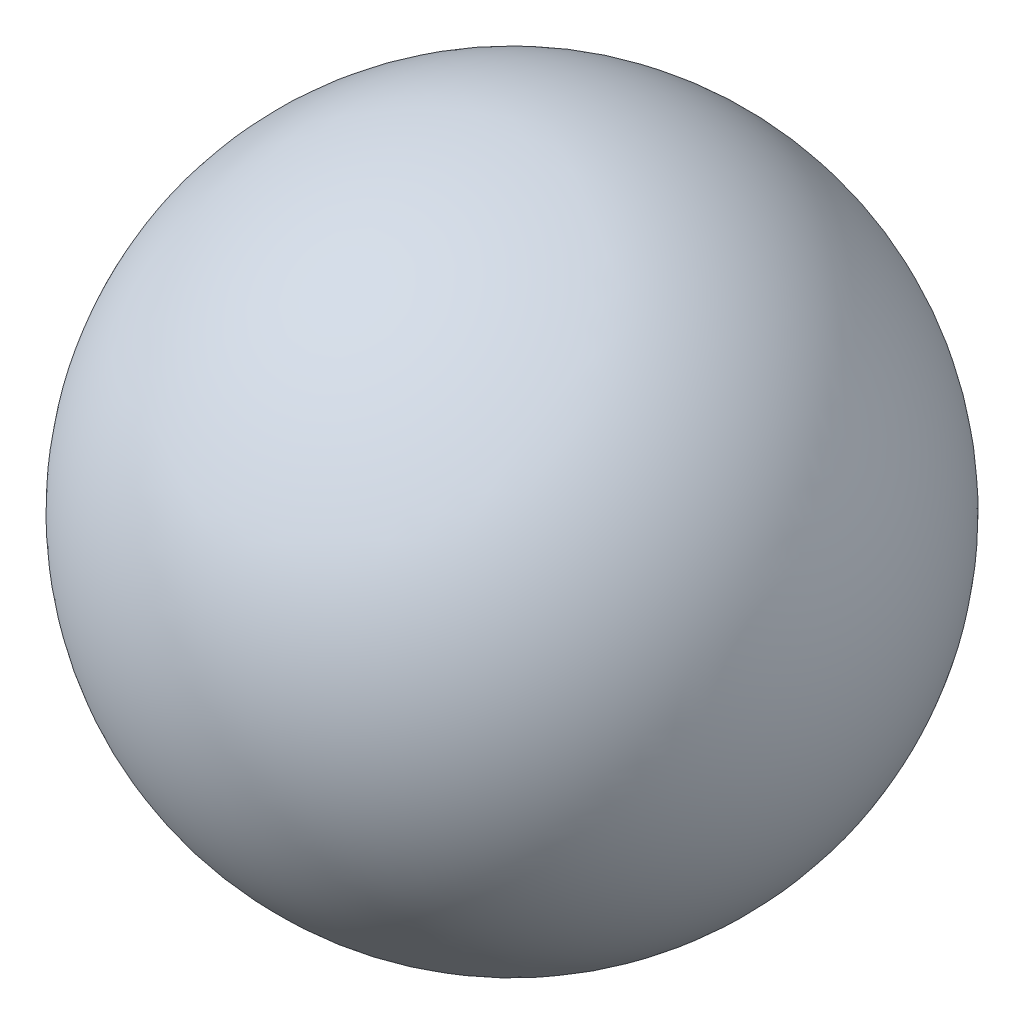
from build123d import *


with BuildPart() as part:
    # Esquisse1 → R_volution4 (revolve)
    with BuildSketch(Plane(origin=(0, 0, 0), x_dir=(1, 0, 0), z_dir=(0, 1, 0))):
        with BuildLine():
            Line((-6.15, 0), (6.15, 0))
            ThreePointArc((6.15, 0), (0, -6.15), (-6.15, 0))
        make_face()
    revolve(axis=Axis((-6.15, 0, 0), (1, 0, 0)))


solid = part.part
